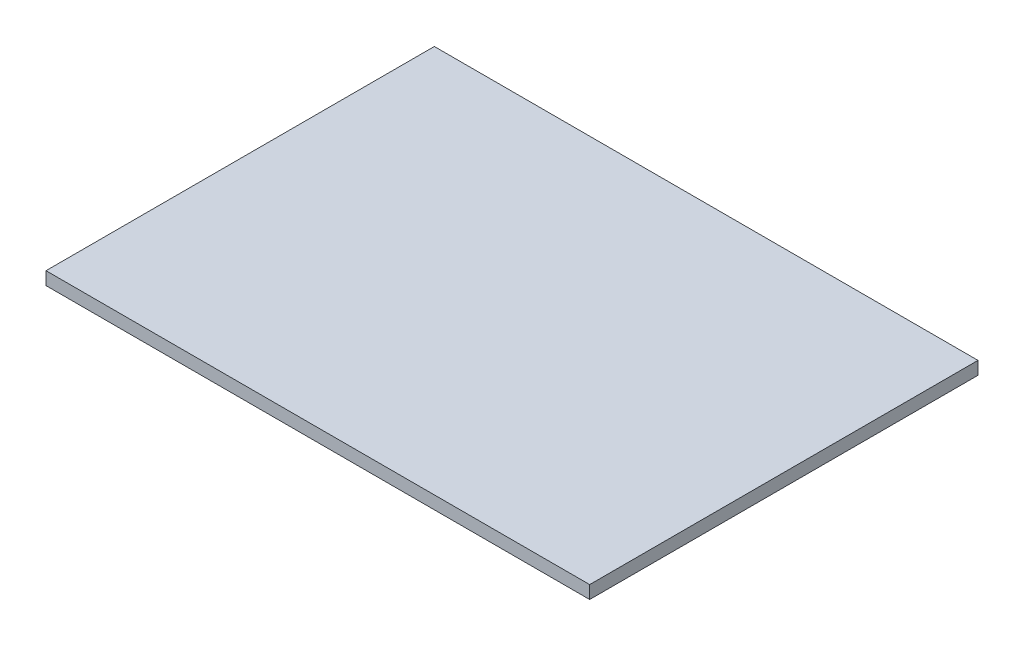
from build123d import *

# Parameters (mm, degrees)
SKETCH1_W           = 42
SKETCH1_H           = 30
BOSS_EXTRUDE1_DEPTH = 0.5


with BuildPart() as part:
    # Sketch1 → Boss-Extrude1 (new, symmetric)
    with BuildSketch(Plane(origin=(0, 0, 0), x_dir=(1, 0, 0), z_dir=(0, 1, 0))):
        Rectangle(SKETCH1_W, SKETCH1_H)
    extrude(amount=BOSS_EXTRUDE1_DEPTH, both=True)


solid = part.part
